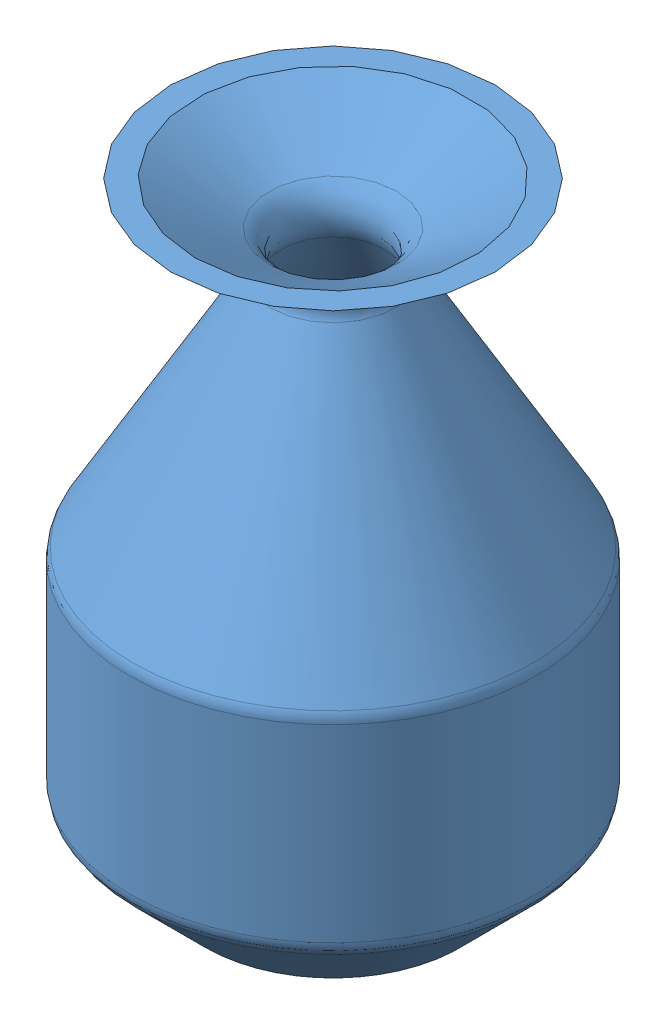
SolidWorks assembly Vase with Spheres.SLDASM, configuration Default (file format 11000). Lengths in mm.
Overall size (100 150 100).
5 component instances, 2 part files, 0 mates.
Components (placement in the parent):
- Vase-1: Vase.SLDPRT [Default] at origin size (100 150 100)
- Sphere-1: Sphere.SLDPRT [Default] at (23.4595 44.0307 -7.4901) size (15 15 15)
- Sphere-2: Sphere.SLDPRT [Default] at (12.8095 63.9428 -11.1354) size (15 15 15)
- Sphere-3: Sphere.SLDPRT [Default] at (-13.028 92.2778 -18.9785) size (15 15 15)
- Sphere-4: Sphere.SLDPRT [Default] at (2.9134 80.1131 -10.7225) size (15 15 15)
